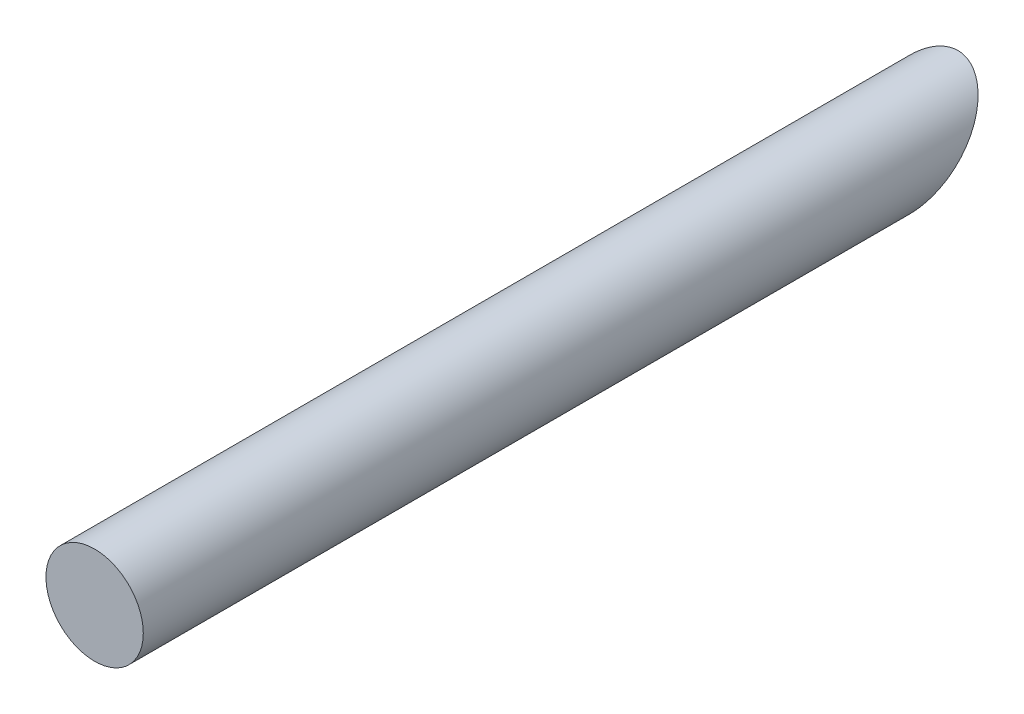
ISO-10303-21;
HEADER;
FILE_DESCRIPTION(('STEP AP214'),'2;1');
FILE_NAME('part.step','',(''),(''),'','','');
FILE_SCHEMA(('AUTOMOTIVE_DESIGN { 1 0 10303 214 1 1 1 1 }'));
ENDSEC;
DATA;
#1=APPLICATION_CONTEXT('core data for automotive mechanical design processes');
#2=APPLICATION_PROTOCOL_DEFINITION('international standard','automotive_design',2000,#1);
#3=PRODUCT_CONTEXT('',#1,'mechanical');
#4=PRODUCT('Part','Part','',(#3));
#5=PRODUCT_RELATED_PRODUCT_CATEGORY('part','',(#4));
#6=PRODUCT_DEFINITION_FORMATION('','',#4);
#7=PRODUCT_DEFINITION_CONTEXT('part definition',#1,'design');
#8=PRODUCT_DEFINITION('design','',#6,#7);
#9=PRODUCT_DEFINITION_SHAPE('','',#8);
#10=(LENGTH_UNIT() NAMED_UNIT(*) SI_UNIT(.MILLI.,.METRE.));
#11=(NAMED_UNIT(*) PLANE_ANGLE_UNIT() SI_UNIT($,.RADIAN.));
#12=(NAMED_UNIT(*) SI_UNIT($,.STERADIAN.) SOLID_ANGLE_UNIT());
#13=UNCERTAINTY_MEASURE_WITH_UNIT(LENGTH_MEASURE(1.E-05),#10,'distance_accuracy_value','');
#14=(GEOMETRIC_REPRESENTATION_CONTEXT(3) GLOBAL_UNCERTAINTY_ASSIGNED_CONTEXT((#13)) GLOBAL_UNIT_ASSIGNED_CONTEXT((#10,
#11,#12)) REPRESENTATION_CONTEXT('',''));
#15=CARTESIAN_POINT('',(0.,0.,0.));
#16=DIRECTION('',(0.,0.,1.));
#17=DIRECTION('',(1.,0.,0.));
#18=AXIS2_PLACEMENT_3D('',#15,#16,#17);
#19=CARTESIAN_POINT('',(0.,0.,55.));
#20=DIRECTION('',(0.,0.,-1.));
#21=DIRECTION('',(-1.,0.,0.));
#22=AXIS2_PLACEMENT_3D('',#19,#20,#21);
#23=CYLINDRICAL_SURFACE('',#22,3.1);
#24=CARTESIAN_POINT('',(0.,0.,3.10000000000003));
#25=DIRECTION('',(0.,0.707106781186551,0.707106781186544));
#26=DIRECTION('',(0.,0.707106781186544,-0.707106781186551));
#27=AXIS2_PLACEMENT_3D('',#24,#25,#26);
#28=ELLIPSE('',#27,4.38406204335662,3.1);
#29=CARTESIAN_POINT('',(0.,3.1,0.));
#30=VERTEX_POINT('',#29);
#31=EDGE_CURVE('E30',#30,#30,#28,.T.);
#32=ORIENTED_EDGE('',*,*,#31,.T.);
#33=EDGE_LOOP('',(#32));
#34=FACE_BOUND('',#33,.T.);
#35=CARTESIAN_POINT('',(0.,0.,55.));
#36=DIRECTION('',(0.,0.,1.));
#37=DIRECTION('',(1.,0.,0.));
#38=AXIS2_PLACEMENT_3D('',#35,#36,#37);
#39=CIRCLE('',#38,3.1);
#40=CARTESIAN_POINT('',(3.1,0.,55.));
#41=VERTEX_POINT('',#40);
#42=EDGE_CURVE('E10',#41,#41,#39,.T.);
#43=ORIENTED_EDGE('',*,*,#42,.F.);
#44=EDGE_LOOP('',(#43));
#45=FACE_BOUND('',#44,.T.);
#46=ADVANCED_FACE('F24',(#34,#45),#23,.T.);
#47=CARTESIAN_POINT('',(0.,0.,55.));
#48=DIRECTION('',(0.,0.,1.));
#49=DIRECTION('',(1.,0.,0.));
#50=AXIS2_PLACEMENT_3D('',#47,#48,#49);
#51=PLANE('',#50);
#52=ORIENTED_EDGE('',*,*,#42,.T.);
#53=EDGE_LOOP('',(#52));
#54=FACE_BOUND('',#53,.T.);
#55=ADVANCED_FACE('F40',(#54),#51,.T.);
#56=CARTESIAN_POINT('',(-5.,-5.33723617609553,8.43723617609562));
#57=DIRECTION('',(0.,0.707106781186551,0.707106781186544));
#58=DIRECTION('',(0.,-0.707106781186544,0.707106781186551));
#59=AXIS2_PLACEMENT_3D('',#56,#57,#58);
#60=PLANE('',#59);
#61=ORIENTED_EDGE('',*,*,#31,.F.);
#62=EDGE_LOOP('',(#61));
#63=FACE_BOUND('',#62,.T.);
#64=ADVANCED_FACE('F38',(#63),#60,.F.);
#65=CLOSED_SHELL('',(#46,#55,#64));
#66=MANIFOLD_SOLID_BREP('B2',#65);
#67=ADVANCED_BREP_SHAPE_REPRESENTATION('',(#18,#66),#14);
#68=SHAPE_DEFINITION_REPRESENTATION(#9,#67);
ENDSEC;
END-ISO-10303-21;
